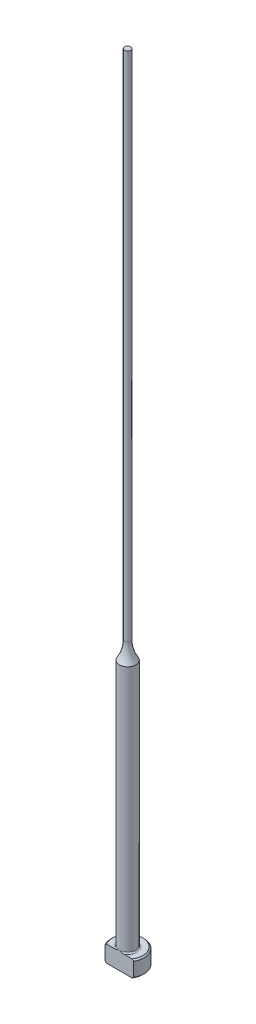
ISO-10303-21;
HEADER;
FILE_DESCRIPTION(('STEP AP214'),'2;1');
FILE_NAME('part.step','',(''),(''),'','','');
FILE_SCHEMA(('AUTOMOTIVE_DESIGN { 1 0 10303 214 1 1 1 1 }'));
ENDSEC;
DATA;
#1=APPLICATION_CONTEXT('core data for automotive mechanical design processes');
#2=APPLICATION_PROTOCOL_DEFINITION('international standard','automotive_design',2000,#1);
#3=PRODUCT_CONTEXT('',#1,'mechanical');
#4=PRODUCT('Part','Part','',(#3));
#5=PRODUCT_RELATED_PRODUCT_CATEGORY('part','',(#4));
#6=PRODUCT_DEFINITION_FORMATION('','',#4);
#7=PRODUCT_DEFINITION_CONTEXT('part definition',#1,'design');
#8=PRODUCT_DEFINITION('design','',#6,#7);
#9=PRODUCT_DEFINITION_SHAPE('','',#8);
#10=(LENGTH_UNIT() NAMED_UNIT(*) SI_UNIT(.MILLI.,.METRE.));
#11=(NAMED_UNIT(*) PLANE_ANGLE_UNIT() SI_UNIT($,.RADIAN.));
#12=(NAMED_UNIT(*) SI_UNIT($,.STERADIAN.) SOLID_ANGLE_UNIT());
#13=UNCERTAINTY_MEASURE_WITH_UNIT(LENGTH_MEASURE(1.E-05),#10,'distance_accuracy_value','');
#14=(GEOMETRIC_REPRESENTATION_CONTEXT(3) GLOBAL_UNCERTAINTY_ASSIGNED_CONTEXT((#13)) GLOBAL_UNIT_ASSIGNED_CONTEXT((#10,
#11,#12)) REPRESENTATION_CONTEXT('',''));
#15=CARTESIAN_POINT('',(0.,0.,0.));
#16=DIRECTION('',(0.,0.,1.));
#17=DIRECTION('',(1.,0.,0.));
#18=AXIS2_PLACEMENT_3D('',#15,#16,#17);
#19=CARTESIAN_POINT('',(-0.594359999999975,152.4,0.));
#20=DIRECTION('',(0.,1.,0.));
#21=DIRECTION('',(0.,0.,1.));
#22=AXIS2_PLACEMENT_3D('',#19,#20,#21);
#23=PLANE('',#22);
#24=CARTESIAN_POINT('',(0.,152.4,0.));
#25=DIRECTION('',(0.,1.,0.));
#26=DIRECTION('',(0.,0.,1.));
#27=AXIS2_PLACEMENT_3D('',#24,#25,#26);
#28=CIRCLE('',#27,0.594359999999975);
#29=CARTESIAN_POINT('',(0.,152.4,0.594359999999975));
#30=VERTEX_POINT('',#29);
#31=EDGE_CURVE('E169',#30,#30,#28,.T.);
#32=ORIENTED_EDGE('',*,*,#31,.T.);
#33=EDGE_LOOP('',(#32));
#34=FACE_BOUND('',#33,.T.);
#35=ADVANCED_FACE('F37',(#34),#23,.T.);
#36=CARTESIAN_POINT('',(0.,259.958771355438,0.));
#37=DIRECTION('',(0.,1.,0.));
#38=DIRECTION('',(0.,0.,1.));
#39=AXIS2_PLACEMENT_3D('',#36,#37,#38);
#40=CYLINDRICAL_SURFACE('',#39,0.594359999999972);
#41=CARTESIAN_POINT('',(0.,54.2097728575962,0.));
#42=DIRECTION('',(0.,1.,0.));
#43=DIRECTION('',(0.,0.,1.));
#44=AXIS2_PLACEMENT_3D('',#41,#42,#43);
#45=CIRCLE('',#44,0.59435999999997);
#46=CARTESIAN_POINT('',(0.,54.2097728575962,0.59435999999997));
#47=VERTEX_POINT('',#46);
#48=EDGE_CURVE('E172',#47,#47,#45,.T.);
#49=ORIENTED_EDGE('',*,*,#48,.T.);
#50=EDGE_LOOP('',(#49));
#51=FACE_BOUND('',#50,.T.);
#52=ORIENTED_EDGE('',*,*,#31,.F.);
#53=EDGE_LOOP('',(#52));
#54=FACE_BOUND('',#53,.T.);
#55=ADVANCED_FACE('F160',(#51,#54),#40,.T.);
#56=CARTESIAN_POINT('',(0.,54.2097728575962,0.));
#57=DIRECTION('',(0.,1.,0.));
#58=DIRECTION('',(0.,0.,1.));
#59=AXIS2_PLACEMENT_3D('',#56,#57,#58);
#60=TOROIDAL_SURFACE('',#59,6.94435999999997,6.35);
#61=CARTESIAN_POINT('',(0.,50.8,0.));
#62=DIRECTION('',(0.,1.,0.));
#63=DIRECTION('',(0.,0.,1.));
#64=AXIS2_PLACEMENT_3D('',#61,#62,#63);
#65=CIRCLE('',#64,1.58749999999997);
#66=CARTESIAN_POINT('',(0.,50.8,1.58749999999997));
#67=VERTEX_POINT('',#66);
#68=EDGE_CURVE('E100',#67,#67,#65,.T.);
#69=ORIENTED_EDGE('',*,*,#68,.T.);
#70=EDGE_LOOP('',(#69));
#71=FACE_BOUND('',#70,.T.);
#72=ORIENTED_EDGE('',*,*,#48,.F.);
#73=EDGE_LOOP('',(#72));
#74=FACE_BOUND('',#73,.T.);
#75=ADVANCED_FACE('F165',(#71,#74),#60,.F.);
#76=CARTESIAN_POINT('',(0.,259.958771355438,0.));
#77=DIRECTION('',(0.,1.,0.));
#78=DIRECTION('',(0.,0.,1.));
#79=AXIS2_PLACEMENT_3D('',#76,#77,#78);
#80=CYLINDRICAL_SURFACE('',#79,1.58749999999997);
#81=CARTESIAN_POINT('',(0.,3.42900000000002,0.));
#82=DIRECTION('',(0.,1.,0.));
#83=DIRECTION('',(0.,0.,1.));
#84=AXIS2_PLACEMENT_3D('',#81,#82,#83);
#85=CIRCLE('',#84,1.58749999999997);
#86=CARTESIAN_POINT('',(0.,3.42900000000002,1.58749999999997));
#87=VERTEX_POINT('',#86);
#88=EDGE_CURVE('E109',#87,#87,#85,.T.);
#89=ORIENTED_EDGE('',*,*,#88,.T.);
#90=EDGE_LOOP('',(#89));
#91=FACE_BOUND('',#90,.T.);
#92=ORIENTED_EDGE('',*,*,#68,.F.);
#93=EDGE_LOOP('',(#92));
#94=FACE_BOUND('',#93,.T.);
#95=ADVANCED_FACE('F192',(#91,#94),#80,.T.);
#96=CARTESIAN_POINT('',(-3.17499999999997,3.175,0.));
#97=DIRECTION('',(0.,1.,0.));
#98=DIRECTION('',(0.,0.,1.));
#99=AXIS2_PLACEMENT_3D('',#96,#97,#98);
#100=PLANE('',#99);
#101=DIRECTION('',(-1.,0.,0.));
#102=VECTOR('',#101,1.);
#103=CARTESIAN_POINT('',(-3.17499999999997,3.175,1.58749999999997));
#104=LINE('',#103,#102);
#105=CARTESIAN_POINT('',(2.45195529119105,3.175,1.58749999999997));
#106=VERTEX_POINT('',#105);
#107=CARTESIAN_POINT('',(0.933255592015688,3.175,1.58749999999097));
#108=VERTEX_POINT('',#107);
#109=EDGE_CURVE('E58',#106,#108,#104,.T.);
#110=ORIENTED_EDGE('',*,*,#109,.F.);
#111=CARTESIAN_POINT('',(0.,3.175,0.));
#112=DIRECTION('',(0.,1.,0.));
#113=DIRECTION('',(0.,0.,1.));
#114=AXIS2_PLACEMENT_3D('',#111,#112,#113);
#115=CIRCLE('',#114,2.92099999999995);
#116=CARTESIAN_POINT('',(-2.45195529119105,3.175,1.58749999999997));
#117=VERTEX_POINT('',#116);
#118=EDGE_CURVE('E171',#106,#117,#115,.T.);
#119=ORIENTED_EDGE('',*,*,#118,.T.);
#120=CARTESIAN_POINT('',(-0.933255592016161,3.17500000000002,1.58749999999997));
#121=VERTEX_POINT('',#120);
#122=EDGE_CURVE('E140',#121,#117,#104,.T.);
#123=ORIENTED_EDGE('',*,*,#122,.F.);
#124=CARTESIAN_POINT('',(0.,3.175,0.));
#125=DIRECTION('',(0.,1.,0.));
#126=DIRECTION('',(0.,0.,1.));
#127=AXIS2_PLACEMENT_3D('',#124,#125,#126);
#128=CIRCLE('',#127,1.84149999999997);
#129=EDGE_CURVE('E113',#121,#108,#128,.F.);
#130=ORIENTED_EDGE('',*,*,#129,.T.);
#131=EDGE_LOOP('',(#110,#119,#123,#130));
#132=FACE_BOUND('',#131,.T.);
#133=ADVANCED_FACE('F189',(#132),#100,.T.);
#134=CARTESIAN_POINT('',(0.,259.958771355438,0.));
#135=DIRECTION('',(0.,1.,0.));
#136=DIRECTION('',(0.,0.,1.));
#137=AXIS2_PLACEMENT_3D('',#134,#135,#136);
#138=CYLINDRICAL_SURFACE('',#137,3.17499999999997);
#139=DIRECTION('',(0.,-1.,0.));
#140=VECTOR('',#139,1.);
#141=CARTESIAN_POINT('',(-2.74963065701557,152.4,1.58749999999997));
#142=LINE('',#141,#140);
#143=CARTESIAN_POINT('',(-2.74963065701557,2.921,1.58749999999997));
#144=VERTEX_POINT('',#143);
#145=CARTESIAN_POINT('',(-2.74963065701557,0.254000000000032,1.58749999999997));
#146=VERTEX_POINT('',#145);
#147=EDGE_CURVE('E95',#144,#146,#142,.T.);
#148=ORIENTED_EDGE('',*,*,#147,.F.);
#149=CARTESIAN_POINT('',(0.,2.92100000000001,0.));
#150=DIRECTION('',(0.,1.,0.));
#151=DIRECTION('',(0.,0.,1.));
#152=AXIS2_PLACEMENT_3D('',#149,#150,#151);
#153=CIRCLE('',#152,3.17499999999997);
#154=CARTESIAN_POINT('',(2.74963065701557,2.921,1.58749999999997));
#155=VERTEX_POINT('',#154);
#156=EDGE_CURVE('E110',#144,#155,#153,.F.);
#157=ORIENTED_EDGE('',*,*,#156,.T.);
#158=DIRECTION('',(0.,-1.,0.));
#159=VECTOR('',#158,1.);
#160=CARTESIAN_POINT('',(2.74963065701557,152.4,1.58749999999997));
#161=LINE('',#160,#159);
#162=CARTESIAN_POINT('',(2.74963065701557,0.254000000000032,1.58749999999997));
#163=VERTEX_POINT('',#162);
#164=EDGE_CURVE('E182',#155,#163,#161,.T.);
#165=ORIENTED_EDGE('',*,*,#164,.T.);
#166=CARTESIAN_POINT('',(0.,0.254000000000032,0.));
#167=DIRECTION('',(0.,-1.,0.));
#168=DIRECTION('',(0.,0.,-1.));
#169=AXIS2_PLACEMENT_3D('',#166,#167,#168);
#170=CIRCLE('',#169,3.17499999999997);
#171=EDGE_CURVE('E116',#163,#146,#170,.F.);
#172=ORIENTED_EDGE('',*,*,#171,.T.);
#173=EDGE_LOOP('',(#148,#157,#165,#172));
#174=FACE_BOUND('',#173,.T.);
#175=ADVANCED_FACE('F180',(#174),#138,.T.);
#176=CARTESIAN_POINT('',(0.,0.,0.));
#177=DIRECTION('',(0.,-1.,0.));
#178=DIRECTION('',(0.,0.,-1.));
#179=AXIS2_PLACEMENT_3D('',#176,#177,#178);
#180=PLANE('',#179);
#181=DIRECTION('',(1.,0.,0.));
#182=VECTOR('',#181,1.);
#183=CARTESIAN_POINT('',(-2.74963065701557,0.,1.58749999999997));
#184=LINE('',#183,#182);
#185=CARTESIAN_POINT('',(-2.45195529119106,0.,1.58749999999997));
#186=VERTEX_POINT('',#185);
#187=CARTESIAN_POINT('',(2.45195529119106,0.,1.58749999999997));
#188=VERTEX_POINT('',#187);
#189=EDGE_CURVE('E92',#186,#188,#184,.T.);
#190=ORIENTED_EDGE('',*,*,#189,.F.);
#191=CARTESIAN_POINT('',(0.,0.,0.));
#192=DIRECTION('',(0.,-1.,0.));
#193=DIRECTION('',(0.,0.,-1.));
#194=AXIS2_PLACEMENT_3D('',#191,#192,#193);
#195=CIRCLE('',#194,2.92099999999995);
#196=EDGE_CURVE('E106',#186,#188,#195,.T.);
#197=ORIENTED_EDGE('',*,*,#196,.T.);
#198=EDGE_LOOP('',(#190,#197));
#199=FACE_BOUND('',#198,.T.);
#200=ADVANCED_FACE('F105',(#199),#180,.T.);
#201=CARTESIAN_POINT('',(0.,3.17499999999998,0.));
#202=DIRECTION('',(0.,-1.,0.));
#203=DIRECTION('',(0.,0.,-1.));
#204=AXIS2_PLACEMENT_3D('',#201,#202,#203);
#205=CONICAL_SURFACE('',#204,2.92099999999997,0.7853981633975);
#206=CARTESIAN_POINT('',(2.75033065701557,2.9203937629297,1.58749999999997));
#207=CARTESIAN_POINT('',(2.66887796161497,2.99091042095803,1.58749999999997));
#208=CARTESIAN_POINT('',(2.58705989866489,3.0610138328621,1.58749999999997));
#209=CARTESIAN_POINT('',(2.42241022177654,3.20009957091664,1.58749999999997));
#210=CARTESIAN_POINT('',(2.33957813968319,3.26908134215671,1.58749999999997));
#211=CARTESIAN_POINT('',(2.17073968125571,3.40716024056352,1.58749999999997));
#212=CARTESIAN_POINT('',(2.08470440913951,3.47622217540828,1.58749999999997));
#213=CARTESIAN_POINT('',(1.91099881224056,3.61222325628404,1.58749999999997));
#214=CARTESIAN_POINT('',(1.82332890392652,3.67916293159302,1.58749999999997));
#215=CARTESIAN_POINT('',(1.64569223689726,3.81020667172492,1.58749999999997));
#216=CARTESIAN_POINT('',(1.55572245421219,3.87430666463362,1.58749999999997));
#217=CARTESIAN_POINT('',(1.37280394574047,3.99833089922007,1.58749999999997));
#218=CARTESIAN_POINT('',(1.27985285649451,4.05825170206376,1.58749999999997));
#219=CARTESIAN_POINT('',(1.09086561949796,4.17130826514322,1.58749999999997));
#220=CARTESIAN_POINT('',(0.99485990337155,4.22449421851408,1.58749999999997));
#221=CARTESIAN_POINT('',(0.798114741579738,4.32122233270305,1.58749999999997));
#222=CARTESIAN_POINT('',(0.697384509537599,4.36478238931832,1.58749999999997));
#223=CARTESIAN_POINT('',(0.541185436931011,4.4195165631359,1.58749999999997));
#224=CARTESIAN_POINT('',(0.487627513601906,4.43611950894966,1.58749999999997));
#225=CARTESIAN_POINT('',(0.379267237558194,4.46466012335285,1.58749999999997));
#226=CARTESIAN_POINT('',(0.324465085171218,4.47659853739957,1.58749999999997));
#227=CARTESIAN_POINT('',(0.214272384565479,4.49501904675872,1.58749999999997));
#228=CARTESIAN_POINT('',(0.158887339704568,4.50153345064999,1.58749999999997));
#229=CARTESIAN_POINT('',(0.0477364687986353,4.50875028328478,1.58749999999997));
#230=CARTESIAN_POINT('',(-0.00802931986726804,4.50945327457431,1.58749999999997));
#231=CARTESIAN_POINT('',(-0.119372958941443,4.50499163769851,1.58749999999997));
#232=CARTESIAN_POINT('',(-0.174950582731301,4.49982147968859,1.58749999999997));
#233=CARTESIAN_POINT('',(-0.285312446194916,4.48399101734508,1.58749999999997));
#234=CARTESIAN_POINT('',(-0.340096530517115,4.47332965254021,1.58749999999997));
#235=CARTESIAN_POINT('',(-0.448865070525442,4.44711334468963,1.58749999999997));
#236=CARTESIAN_POINT('',(-0.50284128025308,4.43152477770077,1.58749999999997));
#237=CARTESIAN_POINT('',(-0.609429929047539,4.39628553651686,1.58749999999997));
#238=CARTESIAN_POINT('',(-0.66204236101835,4.3766348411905,1.58749999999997));
#239=CARTESIAN_POINT('',(-0.778129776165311,4.32902110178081,1.58749999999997));
#240=CARTESIAN_POINT('',(-0.84124591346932,4.30019026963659,1.58749999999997));
#241=CARTESIAN_POINT('',(-0.965594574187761,4.23868811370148,1.58749999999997));
#242=CARTESIAN_POINT('',(-1.02682597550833,4.20601455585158,1.58749999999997));
#243=CARTESIAN_POINT('',(-1.14774341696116,4.13769010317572,1.58749999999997));
#244=CARTESIAN_POINT('',(-1.20742632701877,4.10203371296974,1.58749999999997));
#245=CARTESIAN_POINT('',(-1.32539130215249,4.02846531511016,1.58749999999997));
#246=CARTESIAN_POINT('',(-1.38367308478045,3.9905528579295,1.58749999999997));
#247=CARTESIAN_POINT('',(-1.55734442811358,3.87382704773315,1.58749999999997));
#248=CARTESIAN_POINT('',(-1.67095842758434,3.79237897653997,1.58749999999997));
#249=CARTESIAN_POINT('',(-1.8947523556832,3.6252186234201,1.58749999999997));
#250=CARTESIAN_POINT('',(-2.00493591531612,3.53951111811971,1.58749999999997));
#251=CARTESIAN_POINT('',(-2.22248693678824,3.3655494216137,1.58749999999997));
#252=CARTESIAN_POINT('',(-2.32986450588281,3.27730782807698,1.58749999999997));
#253=CARTESIAN_POINT('',(-2.48909538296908,3.14389342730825,1.58749999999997));
#254=CARTESIAN_POINT('',(-2.54159338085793,3.09948435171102,1.58749999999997));
#255=CARTESIAN_POINT('',(-2.64622282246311,3.01024124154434,1.58749999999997));
#256=CARTESIAN_POINT('',(-2.69835428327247,2.96540722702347,1.58749999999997));
#257=CARTESIAN_POINT('',(-2.75033065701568,2.92039376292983,1.58749999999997));
#258=B_SPLINE_CURVE_WITH_KNOTS('',3,(#206,#207,#208,#209,#210,#211,#212,#213,#214,#215,#216,
#217,#218,#219,#220,#221,#222,#223,#224,#225,#226,#227,#228,#229,#230,#231,#232,#233,#234,#235,
#236,#237,#238,#239,#240,#241,#242,#243,#244,#245,#246,#247,#248,#249,#250,#251,#252,#253,#254,
#255,#256,#257),.UNSPECIFIED.,.F.,.F.,(4,2,2,2,2,2,2,2,2,2,2,2,2,2,2,2,2,2,2,2,2,2,2,2,2,4),(0.,
0.323216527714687,0.64658837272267,0.977539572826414,1.30840757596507,1.63973560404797,
1.97133312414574,2.30029221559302,2.62863448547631,2.79668277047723,2.9647041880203,
3.13171746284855,3.29871457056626,3.46586904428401,3.63305581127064,3.80140905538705,
3.96976317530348,4.17775353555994,4.38586541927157,4.59436953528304,4.80291533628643,
5.22209642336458,5.64081759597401,6.0577303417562,6.26401477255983,6.47028951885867),.UNSPECIFIED.);
#259=EDGE_CURVE('E63',#155,#106,#258,.T.);
#260=ORIENTED_EDGE('',*,*,#259,.F.);
#261=ORIENTED_EDGE('',*,*,#156,.F.);
#262=EDGE_CURVE('E133',#117,#144,#258,.T.);
#263=ORIENTED_EDGE('',*,*,#262,.F.);
#264=ORIENTED_EDGE('',*,*,#118,.F.);
#265=EDGE_LOOP('',(#260,#261,#263,#264));
#266=FACE_BOUND('',#265,.T.);
#267=ADVANCED_FACE('F147',(#266),#205,.T.);
#268=CARTESIAN_POINT('',(0.,0.254000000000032,0.));
#269=DIRECTION('',(0.,1.,0.));
#270=DIRECTION('',(0.,0.,1.));
#271=AXIS2_PLACEMENT_3D('',#268,#269,#270);
#272=CONICAL_SURFACE('',#271,3.17499999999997,0.785398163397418);
#273=CARTESIAN_POINT('',(-2.75033065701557,0.254606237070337,1.58749999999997));
#274=CARTESIAN_POINT('',(-2.66887796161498,0.184089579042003,1.58749999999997));
#275=CARTESIAN_POINT('',(-2.58705989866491,0.113986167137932,1.58749999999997));
#276=CARTESIAN_POINT('',(-2.42241022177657,-0.0250995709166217,1.58749999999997));
#277=CARTESIAN_POINT('',(-2.33957813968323,-0.0940813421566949,1.58749999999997));
#278=CARTESIAN_POINT('',(-2.17073968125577,-0.232160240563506,1.58749999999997));
#279=CARTESIAN_POINT('',(-2.08470440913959,-0.301222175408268,1.58749999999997));
#280=CARTESIAN_POINT('',(-1.91099881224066,-0.437223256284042,1.58749999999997));
#281=CARTESIAN_POINT('',(-1.82332890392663,-0.504162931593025,1.58749999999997));
#282=CARTESIAN_POINT('',(-1.64569223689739,-0.635206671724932,1.58749999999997));
#283=CARTESIAN_POINT('',(-1.55572245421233,-0.699306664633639,1.58749999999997));
#284=CARTESIAN_POINT('',(-1.37280394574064,-0.8233308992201,1.58749999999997));
#285=CARTESIAN_POINT('',(-1.27985285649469,-0.883251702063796,1.58749999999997));
#286=CARTESIAN_POINT('',(-1.09086561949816,-0.996308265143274,1.58749999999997));
#287=CARTESIAN_POINT('',(-0.994859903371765,-1.04949421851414,1.58749999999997));
#288=CARTESIAN_POINT('',(-0.798114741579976,-1.14622233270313,1.58749999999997));
#289=CARTESIAN_POINT('',(-0.697384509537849,-1.18978238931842,1.58749999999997));
#290=CARTESIAN_POINT('',(-0.54118543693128,-1.24451656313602,1.58749999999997));
#291=CARTESIAN_POINT('',(-0.487627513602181,-1.26111950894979,1.58749999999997));
#292=CARTESIAN_POINT('',(-0.379267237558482,-1.28966012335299,1.58749999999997));
#293=CARTESIAN_POINT('',(-0.324465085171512,-1.30159853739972,1.58749999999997));
#294=CARTESIAN_POINT('',(-0.214272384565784,-1.3200190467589,1.58749999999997));
#295=CARTESIAN_POINT('',(-0.158887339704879,-1.32653345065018,1.58749999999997));
#296=CARTESIAN_POINT('',(-0.0477364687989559,-1.33375028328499,1.58749999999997));
#297=CARTESIAN_POINT('',(0.00802931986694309,-1.33445327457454,1.58749999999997));
#298=CARTESIAN_POINT('',(0.119372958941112,-1.32999163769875,1.58749999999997));
#299=CARTESIAN_POINT('',(0.174950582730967,-1.32482147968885,1.58749999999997));
#300=CARTESIAN_POINT('',(0.28531244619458,-1.30899101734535,1.58749999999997));
#301=CARTESIAN_POINT('',(0.340096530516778,-1.2983296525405,1.58749999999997));
#302=CARTESIAN_POINT('',(0.448865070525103,-1.27211334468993,1.58749999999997));
#303=CARTESIAN_POINT('',(0.50284128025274,-1.25652477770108,1.58749999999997));
#304=CARTESIAN_POINT('',(0.609429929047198,-1.22128553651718,1.58749999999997));
#305=CARTESIAN_POINT('',(0.662042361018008,-1.20163484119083,1.58749999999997));
#306=CARTESIAN_POINT('',(0.778129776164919,-1.15402110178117,1.58749999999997));
#307=CARTESIAN_POINT('',(0.84124591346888,-1.12519026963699,1.58749999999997));
#308=CARTESIAN_POINT('',(0.965594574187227,-1.06368811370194,1.58749999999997));
#309=CARTESIAN_POINT('',(1.02682597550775,-1.03101455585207,1.58749999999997));
#310=CARTESIAN_POINT('',(1.14774341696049,-0.962690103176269,1.58749999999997));
#311=CARTESIAN_POINT('',(1.20742632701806,-0.927033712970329,1.58749999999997));
#312=CARTESIAN_POINT('',(1.32539130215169,-0.853465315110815,1.58749999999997));
#313=CARTESIAN_POINT('',(1.38367308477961,-0.815552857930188,1.58749999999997));
#314=CARTESIAN_POINT('',(1.5573444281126,-0.698827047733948,1.58749999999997));
#315=CARTESIAN_POINT('',(1.67095842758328,-0.617378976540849,1.58749999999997));
#316=CARTESIAN_POINT('',(1.89475235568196,-0.450218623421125,1.58749999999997));
#317=CARTESIAN_POINT('',(2.0049359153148,-0.364511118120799,1.58749999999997));
#318=CARTESIAN_POINT('',(2.22248693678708,-0.190549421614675,1.58749999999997));
#319=CARTESIAN_POINT('',(2.32986450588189,-0.102307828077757,1.58749999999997));
#320=CARTESIAN_POINT('',(2.48909538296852,0.0311065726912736,1.58749999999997));
#321=CARTESIAN_POINT('',(2.54159338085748,0.0755156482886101,1.58749999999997));
#322=CARTESIAN_POINT('',(2.64622282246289,0.164758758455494,1.58749999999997));
#323=CARTESIAN_POINT('',(2.69835428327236,0.20959277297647,1.58749999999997));
#324=CARTESIAN_POINT('',(2.75033065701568,0.25460623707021,1.58749999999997));
#325=B_SPLINE_CURVE_WITH_KNOTS('',3,(#273,#274,#275,#276,#277,#278,#279,#280,#281,#282,#283,
#284,#285,#286,#287,#288,#289,#290,#291,#292,#293,#294,#295,#296,#297,#298,#299,#300,#301,#302,
#303,#304,#305,#306,#307,#308,#309,#310,#311,#312,#313,#314,#315,#316,#317,#318,#319,#320,#321,
#322,#323,#324),.UNSPECIFIED.,.F.,.F.,(4,2,2,2,2,2,2,2,2,2,2,2,2,2,2,2,2,2,2,2,2,2,2,2,2,4),(0.,
0.323216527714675,0.646588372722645,0.977539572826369,1.308407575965,1.63973560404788,
1.97133312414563,2.3002922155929,2.62863448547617,2.79668277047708,2.96470418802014,
3.13171746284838,3.29871457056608,3.46586904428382,3.63305581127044,3.80140905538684,
3.96976317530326,4.17775353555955,4.38586541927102,4.59436953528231,4.80291533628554,
5.22209642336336,5.64081759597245,6.05773034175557,6.26401477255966,6.47028951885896),.UNSPECIFIED.);
#326=EDGE_CURVE('E89',#146,#186,#325,.T.);
#327=ORIENTED_EDGE('',*,*,#326,.F.);
#328=ORIENTED_EDGE('',*,*,#171,.F.);
#329=EDGE_CURVE('E101',#188,#163,#325,.T.);
#330=ORIENTED_EDGE('',*,*,#329,.F.);
#331=ORIENTED_EDGE('',*,*,#196,.F.);
#332=EDGE_LOOP('',(#327,#328,#330,#331));
#333=FACE_BOUND('',#332,.T.);
#334=ADVANCED_FACE('F108',(#333),#272,.T.);
#335=CARTESIAN_POINT('',(0.,3.42900000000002,0.));
#336=DIRECTION('',(0.,1.,0.));
#337=DIRECTION('',(0.,0.,1.));
#338=AXIS2_PLACEMENT_3D('',#335,#336,#337);
#339=TOROIDAL_SURFACE('',#338,1.84149999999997,0.254);
#340=ORIENTED_EDGE('',*,*,#129,.F.);
#341=CARTESIAN_POINT('',(0.,3.42900000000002,1.58749999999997));
#342=CARTESIAN_POINT('',(-1.9220500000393E-10,3.42900057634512,1.58749999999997));
#343=CARTESIAN_POINT('',(-1.22611614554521E-07,3.42900115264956,1.58749999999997));
#344=CARTESIAN_POINT('',(-5.09676364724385E-07,3.42900226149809,1.58749999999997));
#345=CARTESIAN_POINT('',(-7.78176327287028E-07,3.42900279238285,1.58749999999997));
#346=CARTESIAN_POINT('',(-1.42307272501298E-06,3.42900385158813,1.58749999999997));
#347=CARTESIAN_POINT('',(-1.80713867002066E-06,3.42900437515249,1.58749999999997));
#348=CARTESIAN_POINT('',(-2.63494846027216E-06,3.42900536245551,1.58749999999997));
#349=CARTESIAN_POINT('',(-3.07814756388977E-06,3.42900582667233,1.58749999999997));
#350=CARTESIAN_POINT('',(-4.66897357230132E-06,3.42900738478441,1.58749999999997));
#351=CARTESIAN_POINT('',(-5.89404907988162E-06,3.42900840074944,1.58749999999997));
#352=CARTESIAN_POINT('',(-8.42427510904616E-06,3.42901020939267,1.58749999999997));
#353=CARTESIAN_POINT('',(-9.72480574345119E-06,3.42901100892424,1.58749999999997));
#354=CARTESIAN_POINT('',(-1.48060601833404E-05,3.42901401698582,1.58749999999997));
#355=CARTESIAN_POINT('',(-1.86838281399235E-05,3.42901606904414,1.58749999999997));
#356=CARTESIAN_POINT('',(-2.63261117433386E-05,3.42901942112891,1.58749999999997));
#357=CARTESIAN_POINT('',(-3.0068741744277E-05,3.42902077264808,1.58749999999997));
#358=CARTESIAN_POINT('',(-4.60276298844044E-05,3.42902652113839,1.58749999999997));
#359=CARTESIAN_POINT('',(-5.82470198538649E-05,3.42903088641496,1.58749999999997));
#360=CARTESIAN_POINT('',(-8.11070097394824E-05,3.42903788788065,1.58749999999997));
#361=CARTESIAN_POINT('',(-9.16953114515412E-05,3.42904068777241,1.58749999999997));
#362=CARTESIAN_POINT('',(-0.000168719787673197,3.42906287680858,1.58749999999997));
#363=CARTESIAN_POINT('',(-0.000232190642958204,3.4290911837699,1.58749999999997));
#364=CARTESIAN_POINT('',(-0.000479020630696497,3.42919723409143,1.58749999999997));
#365=CARTESIAN_POINT('',(-0.000664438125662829,3.42926834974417,1.58749999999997));
#366=CARTESIAN_POINT('',(-0.0013844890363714,3.42954862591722,1.58749999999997));
#367=CARTESIAN_POINT('',(-0.00191701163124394,3.42976473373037,1.58749999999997));
#368=CARTESIAN_POINT('',(-0.00409774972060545,3.4306455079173,1.58749999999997));
#369=CARTESIAN_POINT('',(-0.00574830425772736,3.43130231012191,1.58749999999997));
#370=CARTESIAN_POINT('',(-0.0289985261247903,3.4405594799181,1.58749999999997));
#371=CARTESIAN_POINT('',(-0.0505816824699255,3.4492167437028,1.58749999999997));
#372=CARTESIAN_POINT('',(-0.0929947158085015,3.46610702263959,1.58749999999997));
#373=CARTESIAN_POINT('',(-0.113823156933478,3.47434394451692,1.58749999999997));
#374=CARTESIAN_POINT('',(-0.157956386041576,3.49164606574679,1.58749999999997));
#375=CARTESIAN_POINT('',(-0.181267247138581,3.50069608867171,1.58749999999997));
#376=CARTESIAN_POINT('',(-0.228222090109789,3.51863224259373,1.58749999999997));
#377=CARTESIAN_POINT('',(-0.25186705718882,3.52751579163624,1.58749999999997));
#378=CARTESIAN_POINT('',(-0.310512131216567,3.54905503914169,1.58749999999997));
#379=CARTESIAN_POINT('',(-0.345588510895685,3.56150550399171,1.58749999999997));
#380=CARTESIAN_POINT('',(-0.415278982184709,3.5850302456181,1.58749999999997));
#381=CARTESIAN_POINT('',(-0.449884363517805,3.59613012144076,1.58749999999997));
#382=CARTESIAN_POINT('',(-0.524471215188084,3.61841679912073,1.58749999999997));
#383=CARTESIAN_POINT('',(-0.564517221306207,3.62939137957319,1.58749999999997));
#384=CARTESIAN_POINT('',(-0.645529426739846,3.6489746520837,1.58749999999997));
#385=CARTESIAN_POINT('',(-0.686500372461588,3.65756417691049,1.58749999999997));
#386=CARTESIAN_POINT('',(-0.771546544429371,3.67188287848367,1.58749999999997));
#387=CARTESIAN_POINT('',(-0.815658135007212,3.67740449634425,1.58749999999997));
#388=CARTESIAN_POINT('',(-0.904117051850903,3.68344603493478,1.58749999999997));
#389=CARTESIAN_POINT('',(-0.948462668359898,3.68398638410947,1.58749999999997));
#390=CARTESIAN_POINT('',(-1.02531896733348,3.67901051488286,1.58749999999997));
#391=CARTESIAN_POINT('',(-1.05792141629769,3.67502604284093,1.58749999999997));
#392=CARTESIAN_POINT('',(-1.12184393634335,3.66230832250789,1.58749999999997));
#393=CARTESIAN_POINT('',(-1.1531753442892,3.65363950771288,1.58749999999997));
#394=CARTESIAN_POINT('',(-1.19946468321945,3.6356384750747,1.58749999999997));
#395=CARTESIAN_POINT('',(-1.21526783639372,3.62848492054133,1.58749999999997));
#396=CARTESIAN_POINT('',(-1.24583726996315,3.61212937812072,1.58749999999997));
#397=CARTESIAN_POINT('',(-1.26060215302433,3.60292469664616,1.58749999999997));
#398=CARTESIAN_POINT('',(-1.28575815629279,3.58421518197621,1.58749999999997));
#399=CARTESIAN_POINT('',(-1.29644383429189,3.57510998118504,1.58749999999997));
#400=CARTESIAN_POINT('',(-1.31623154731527,3.55531539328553,1.58749999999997));
#401=CARTESIAN_POINT('',(-1.32533681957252,3.54462932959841,1.58749999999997));
#402=CARTESIAN_POINT('',(-1.33941140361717,3.52450022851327,1.58749999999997));
#403=CARTESIAN_POINT('',(-1.34484814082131,3.51538553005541,1.58749999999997));
#404=CARTESIAN_POINT('',(-1.35416329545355,3.49638544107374,1.58749999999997));
#405=CARTESIAN_POINT('',(-1.35804267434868,3.48650053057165,1.58749999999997));
#406=CARTESIAN_POINT('',(-1.36398436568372,3.46611321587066,1.58749999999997));
#407=CARTESIAN_POINT('',(-1.36603350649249,3.45560690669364,1.58749999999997));
#408=CARTESIAN_POINT('',(-1.3680840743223,3.43439627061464,1.58749999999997));
#409=CARTESIAN_POINT('',(-1.36808648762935,3.42369204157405,1.58749999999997));
#410=CARTESIAN_POINT('',(-1.36616208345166,3.40366716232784,1.58749999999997));
#411=CARTESIAN_POINT('',(-1.36444960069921,3.39432493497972,1.58749999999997));
#412=CARTESIAN_POINT('',(-1.35953338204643,3.37604480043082,1.58749999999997));
#413=CARTESIAN_POINT('',(-1.3563294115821,3.36710695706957,1.58749999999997));
#414=CARTESIAN_POINT('',(-1.34848006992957,3.34949697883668,1.58749999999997));
#415=CARTESIAN_POINT('',(-1.34378578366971,3.34084688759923,1.58749999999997));
#416=CARTESIAN_POINT('',(-1.33324445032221,3.32428742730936,1.58749999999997));
#417=CARTESIAN_POINT('',(-1.32739692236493,3.31637836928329,1.58749999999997));
#418=CARTESIAN_POINT('',(-1.31107304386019,3.29692878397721,1.58749999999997));
#419=CARTESIAN_POINT('',(-1.29989286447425,3.28597778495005,1.58749999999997));
#420=CARTESIAN_POINT('',(-1.27593566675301,3.26597490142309,1.58749999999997));
#421=CARTESIAN_POINT('',(-1.2631537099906,3.25692913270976,1.58749999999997));
#422=CARTESIAN_POINT('',(-1.22930733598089,3.23613976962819,1.58749999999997));
#423=CARTESIAN_POINT('',(-1.20751096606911,3.22559415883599,1.58749999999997));
#424=CARTESIAN_POINT('',(-1.16266144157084,3.20795356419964,1.58749999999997));
#425=CARTESIAN_POINT('',(-1.13960937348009,3.20085564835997,1.58749999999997));
#426=CARTESIAN_POINT('',(-1.07603916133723,3.18534571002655,1.58749999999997));
#427=CARTESIAN_POINT('',(-1.03486686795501,3.17965078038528,1.58749999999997));
#428=CARTESIAN_POINT('',(-0.951558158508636,3.1741711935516,1.58749999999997));
#429=CARTESIAN_POINT('',(-0.909417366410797,3.17449023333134,1.58749999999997));
#430=CARTESIAN_POINT('',(-0.811383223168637,3.18054602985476,1.58749999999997));
#431=CARTESIAN_POINT('',(-0.755610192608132,3.18806126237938,1.58749999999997));
#432=CARTESIAN_POINT('',(-0.644937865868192,3.20866626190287,1.58749999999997));
#433=CARTESIAN_POINT('',(-0.590043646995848,3.2217810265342,1.58749999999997));
#434=CARTESIAN_POINT('',(-0.485757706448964,3.25059077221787,1.58749999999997));
#435=CARTESIAN_POINT('',(-0.436281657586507,3.2659890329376,1.58749999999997));
#436=CARTESIAN_POINT('',(-0.338551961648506,3.29877502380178,1.58749999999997));
#437=CARTESIAN_POINT('',(-0.290291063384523,3.31614156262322,1.58749999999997));
#438=CARTESIAN_POINT('',(-0.225557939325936,3.34039762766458,1.58749999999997));
#439=CARTESIAN_POINT('',(-0.208874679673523,3.34673586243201,1.58749999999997));
#440=CARTESIAN_POINT('',(-0.175123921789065,3.35969957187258,1.58749999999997));
#441=CARTESIAN_POINT('',(-0.158057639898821,3.36632823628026,1.58749999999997));
#442=CARTESIAN_POINT('',(-0.117638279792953,3.38214476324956,1.58749999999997));
#443=CARTESIAN_POINT('',(-0.0943002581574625,3.39137029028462,1.58749999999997));
#444=CARTESIAN_POINT('',(-0.049782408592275,3.40910304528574,1.58749999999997));
#445=CARTESIAN_POINT('',(-0.028598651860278,3.41759960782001,1.58749999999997));
#446=CARTESIAN_POINT('',(-0.00575168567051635,3.42669635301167,1.58749999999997));
#447=CARTESIAN_POINT('',(-0.00410451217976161,3.42735181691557,1.58749999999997));
#448=CARTESIAN_POINT('',(-0.00192459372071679,3.42823223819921,1.58749999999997));
#449=CARTESIAN_POINT('',(-0.00138952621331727,3.42844937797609,1.58749999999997));
#450=CARTESIAN_POINT('',(-0.000666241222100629,3.42873091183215,1.58749999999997));
#451=CARTESIAN_POINT('',(-0.000480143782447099,3.42880228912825,1.58749999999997));
#452=CARTESIAN_POINT('',(-0.000232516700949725,3.4289086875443,1.58749999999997));
#453=CARTESIAN_POINT('',(-0.00016892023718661,3.42893705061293,1.58749999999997));
#454=CARTESIAN_POINT('',(-9.17527161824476E-05,3.42895927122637,1.58749999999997));
#455=CARTESIAN_POINT('',(-8.11550293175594E-05,3.42896207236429,1.58749999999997));
#456=CARTESIAN_POINT('',(-5.82743948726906E-05,3.4289690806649,1.58749999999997));
#457=CARTESIAN_POINT('',(-4.60440001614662E-05,3.4289734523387,1.58749999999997));
#458=CARTESIAN_POINT('',(-3.00727682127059E-05,3.42897920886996,1.58749999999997));
#459=CARTESIAN_POINT('',(-2.63286807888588E-05,3.42898056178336,1.58749999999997));
#460=CARTESIAN_POINT('',(-1.86836529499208E-05,3.42898391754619,1.58749999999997));
#461=CARTESIAN_POINT('',(-1.48046517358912E-05,3.42898597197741,1.58749999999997));
#462=CARTESIAN_POINT('',(-9.72223943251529E-06,3.42898898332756,1.58749999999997));
#463=CARTESIAN_POINT('',(-8.4215964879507E-06,3.4289897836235,1.58749999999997));
#464=CARTESIAN_POINT('',(-5.89129728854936E-06,3.428991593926,1.58749999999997));
#465=CARTESIAN_POINT('',(-4.66626866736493E-06,3.42899261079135,1.58749999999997));
#466=CARTESIAN_POINT('',(-3.07568803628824E-06,3.42899417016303,1.58749999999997));
#467=CARTESIAN_POINT('',(-2.63259565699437E-06,3.42899463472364,1.58749999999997));
#468=CARTESIAN_POINT('',(-1.80506085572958E-06,3.42899562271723,1.58749999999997));
#469=CARTESIAN_POINT('',(-1.42116387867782E-06,3.4289961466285,1.58749999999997));
#470=CARTESIAN_POINT('',(-7.76675642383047E-07,3.42899720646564,1.58749999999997));
#471=CARTESIAN_POINT('',(-5.08406487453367E-07,3.42899773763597,1.58749999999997));
#472=CARTESIAN_POINT('',(-1.21901887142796E-07,3.42899884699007,1.58749999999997));
#473=CARTESIAN_POINT('',(1.92251529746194E-10,3.42899942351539,1.58749999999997));
#474=CARTESIAN_POINT('',(0.,3.42900000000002,1.58749999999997));
#475=B_SPLINE_CURVE_WITH_KNOTS('',3,(#341,#342,#343,#344,#345,#346,#347,#348,#349,#350,#351,
#352,#353,#354,#355,#356,#357,#358,#359,#360,#361,#362,#363,#364,#365,#366,#367,#368,#369,#370,
#371,#372,#373,#374,#375,#376,#377,#378,#379,#380,#381,#382,#383,#384,#385,#386,#387,#388,#389,
#390,#391,#392,#393,#394,#395,#396,#397,#398,#399,#400,#401,#402,#403,#404,#405,#406,#407,#408,
#409,#410,#411,#412,#413,#414,#415,#416,#417,#418,#419,#420,#421,#422,#423,#424,#425,#426,#427,
#428,#429,#430,#431,#432,#433,#434,#435,#436,#437,#438,#439,#440,#441,#442,#443,#444,#445,#446,
#447,#448,#449,#450,#451,#452,#453,#454,#455,#456,#457,#458,#459,#460,#461,#462,#463,#464,#465,
#466,#467,#468,#469,#470,#471,#472,#473,#474),.UNSPECIFIED.,.T.,.F.,(4,2,2,2,2,2,2,2,2,2,2,2,2,
2,2,2,2,2,2,2,2,2,2,2,2,2,2,2,2,2,2,2,2,2,2,2,2,2,2,2,2,2,2,2,2,2,2,2,2,2,2,2,2,2,2,2,2,2,2,2,2,
2,2,2,2,2,4),(0.,1.72815459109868E-06,3.50429256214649E-06,5.44431005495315E-06,
7.36755250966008E-06,1.21190896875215E-05,1.66953775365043E-05,2.98160400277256E-05,
4.17409564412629E-05,8.06604753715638E-05,0.000113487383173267,0.000321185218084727,
0.000917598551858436,0.00264089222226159,0.00797105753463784,0.0777276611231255,
0.144923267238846,0.219939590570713,0.295714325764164,0.407362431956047,0.516367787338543,
0.640878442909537,0.766362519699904,0.899536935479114,1.03216495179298,1.130457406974,
1.22743103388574,1.27935899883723,1.33135556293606,1.3733324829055,1.41522237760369,
1.44693946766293,1.47863694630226,1.51056074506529,1.54246916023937,1.57083210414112,
1.59919951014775,1.62861579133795,1.65804436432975,1.70472658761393,1.75155645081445,
1.82378709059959,1.89595619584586,2.01995471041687,2.14609321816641,2.31447224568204,
2.4836109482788,2.63898919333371,2.79283011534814,2.8463703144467,2.90129461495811,
2.9765823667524,3.04504771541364,3.05036697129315,3.0520984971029,3.0526970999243,
3.05290520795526,3.05293806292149,3.05297701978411,3.05298895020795,3.05300207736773,
3.05300665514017,3.05301140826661,3.0530133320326,3.05301527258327,3.05301704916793,
3.05301877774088),.UNSPECIFIED.);
#476=EDGE_CURVE('E11',#121,#87,#475,.T.);
#477=ORIENTED_EDGE('',*,*,#476,.T.);
#478=ORIENTED_EDGE('',*,*,#88,.F.);
#479=CARTESIAN_POINT('',(0.,3.42900000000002,1.58749999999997));
#480=CARTESIAN_POINT('',(1.92205030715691E-10,3.42899942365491,1.58749999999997));
#481=CARTESIAN_POINT('',(1.22611614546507E-07,3.42899884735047,1.58749999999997));
#482=CARTESIAN_POINT('',(5.09676364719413E-07,3.42899773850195,1.58749999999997));
#483=CARTESIAN_POINT('',(7.78176327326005E-07,3.42899720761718,1.58749999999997));
#484=CARTESIAN_POINT('',(1.42307272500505E-06,3.4289961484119,1.58749999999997));
#485=CARTESIAN_POINT('',(1.80713866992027E-06,3.42899562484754,1.58749999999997));
#486=CARTESIAN_POINT('',(2.63494846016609E-06,3.42899463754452,1.58749999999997));
#487=CARTESIAN_POINT('',(3.07814756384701E-06,3.4289941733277,1.58749999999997));
#488=CARTESIAN_POINT('',(4.66897357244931E-06,3.42899261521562,1.58749999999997));
#489=CARTESIAN_POINT('',(5.89404907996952E-06,3.42899159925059,1.58749999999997));
#490=CARTESIAN_POINT('',(8.42427510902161E-06,3.42898979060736,1.58749999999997));
#491=CARTESIAN_POINT('',(9.72480574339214E-06,3.42898899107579,1.58749999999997));
#492=CARTESIAN_POINT('',(1.48060601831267E-05,3.42898598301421,1.58749999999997));
#493=CARTESIAN_POINT('',(1.86838281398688E-05,3.42898393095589,1.58749999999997));
#494=CARTESIAN_POINT('',(2.63261117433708E-05,3.42898057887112,1.58749999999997));
#495=CARTESIAN_POINT('',(3.00687417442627E-05,3.42897922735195,1.58749999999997));
#496=CARTESIAN_POINT('',(4.6027629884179E-05,3.42897347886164,1.58749999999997));
#497=CARTESIAN_POINT('',(5.82470198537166E-05,3.42896911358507,1.58749999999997));
#498=CARTESIAN_POINT('',(8.1107009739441E-05,3.42896211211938,1.58749999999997));
#499=CARTESIAN_POINT('',(9.16953114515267E-05,3.42895931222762,1.58749999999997));
#500=CARTESIAN_POINT('',(0.00016871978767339,3.42893712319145,1.58749999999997));
#501=CARTESIAN_POINT('',(0.000232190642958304,3.42890881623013,1.58749999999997));
#502=CARTESIAN_POINT('',(0.000479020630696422,3.4288027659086,1.58749999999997));
#503=CARTESIAN_POINT('',(0.000664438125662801,3.42873165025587,1.58749999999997));
#504=CARTESIAN_POINT('',(0.0013844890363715,3.42845137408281,1.58749999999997));
#505=CARTESIAN_POINT('',(0.00191701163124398,3.42823526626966,1.58749999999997));
#506=CARTESIAN_POINT('',(0.00409774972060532,3.42735449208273,1.58749999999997));
#507=CARTESIAN_POINT('',(0.0057483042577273,3.42669768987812,1.58749999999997));
#508=CARTESIAN_POINT('',(0.028998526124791,3.41744052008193,1.58749999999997));
#509=CARTESIAN_POINT('',(0.0505816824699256,3.40878325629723,1.58749999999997));
#510=CARTESIAN_POINT('',(0.0929947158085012,3.39189297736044,1.58749999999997));
#511=CARTESIAN_POINT('',(0.113823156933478,3.38365605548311,1.58749999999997));
#512=CARTESIAN_POINT('',(0.157956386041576,3.36635393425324,1.58749999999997));
#513=CARTESIAN_POINT('',(0.181267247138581,3.35730391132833,1.58749999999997));
#514=CARTESIAN_POINT('',(0.228222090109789,3.3393677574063,1.58749999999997));
#515=CARTESIAN_POINT('',(0.25186705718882,3.33048420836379,1.58749999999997));
#516=CARTESIAN_POINT('',(0.310512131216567,3.30894496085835,1.58749999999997));
#517=CARTESIAN_POINT('',(0.345588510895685,3.29649449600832,1.58749999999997));
#518=CARTESIAN_POINT('',(0.415278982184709,3.27296975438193,1.58749999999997));
#519=CARTESIAN_POINT('',(0.449884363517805,3.26186987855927,1.58749999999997));
#520=CARTESIAN_POINT('',(0.524471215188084,3.2395832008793,1.58749999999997));
#521=CARTESIAN_POINT('',(0.564517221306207,3.22860862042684,1.58749999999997));
#522=CARTESIAN_POINT('',(0.645529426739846,3.20902534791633,1.58749999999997));
#523=CARTESIAN_POINT('',(0.686500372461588,3.20043582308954,1.58749999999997));
#524=CARTESIAN_POINT('',(0.771546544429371,3.18611712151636,1.58749999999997));
#525=CARTESIAN_POINT('',(0.815658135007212,3.18059550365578,1.58749999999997));
#526=CARTESIAN_POINT('',(0.904117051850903,3.17455396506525,1.58749999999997));
#527=CARTESIAN_POINT('',(0.948462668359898,3.17401361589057,1.58749999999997));
#528=CARTESIAN_POINT('',(1.02531896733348,3.17898948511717,1.58749999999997));
#529=CARTESIAN_POINT('',(1.05792141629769,3.1829739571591,1.58749999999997));
#530=CARTESIAN_POINT('',(1.12184393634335,3.19569167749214,1.58749999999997));
#531=CARTESIAN_POINT('',(1.1531753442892,3.20436049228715,1.58749999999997));
#532=CARTESIAN_POINT('',(1.19946468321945,3.22236152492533,1.58749999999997));
#533=CARTESIAN_POINT('',(1.21526783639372,3.2295150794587,1.58749999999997));
#534=CARTESIAN_POINT('',(1.24583726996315,3.24587062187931,1.58749999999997));
#535=CARTESIAN_POINT('',(1.26060215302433,3.25507530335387,1.58749999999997));
#536=CARTESIAN_POINT('',(1.28575815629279,3.27378481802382,1.58749999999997));
#537=CARTESIAN_POINT('',(1.29644383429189,3.28289001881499,1.58749999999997));
#538=CARTESIAN_POINT('',(1.31623154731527,3.30268460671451,1.58749999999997));
#539=CARTESIAN_POINT('',(1.32533681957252,3.31337067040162,1.58749999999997));
#540=CARTESIAN_POINT('',(1.33941140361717,3.33349977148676,1.58749999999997));
#541=CARTESIAN_POINT('',(1.34484814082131,3.34261446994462,1.58749999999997));
#542=CARTESIAN_POINT('',(1.35416329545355,3.36161455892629,1.58749999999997));
#543=CARTESIAN_POINT('',(1.35804267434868,3.37149946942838,1.58749999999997));
#544=CARTESIAN_POINT('',(1.36398436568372,3.39188678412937,1.58749999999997));
#545=CARTESIAN_POINT('',(1.36603350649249,3.40239309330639,1.58749999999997));
#546=CARTESIAN_POINT('',(1.3680840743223,3.42360372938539,1.58749999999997));
#547=CARTESIAN_POINT('',(1.36808648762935,3.43430795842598,1.58749999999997));
#548=CARTESIAN_POINT('',(1.36616208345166,3.45433283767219,1.58749999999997));
#549=CARTESIAN_POINT('',(1.36444960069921,3.46367506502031,1.58749999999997));
#550=CARTESIAN_POINT('',(1.35953338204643,3.48195519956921,1.58749999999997));
#551=CARTESIAN_POINT('',(1.3563294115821,3.49089304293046,1.58749999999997));
#552=CARTESIAN_POINT('',(1.34848006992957,3.50850302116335,1.58749999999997));
#553=CARTESIAN_POINT('',(1.34378578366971,3.5171531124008,1.58749999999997));
#554=CARTESIAN_POINT('',(1.33324445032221,3.53371257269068,1.58749999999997));
#555=CARTESIAN_POINT('',(1.32739692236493,3.54162163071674,1.58749999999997));
#556=CARTESIAN_POINT('',(1.31107304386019,3.56107121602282,1.58749999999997));
#557=CARTESIAN_POINT('',(1.29989286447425,3.57202221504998,1.58749999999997));
#558=CARTESIAN_POINT('',(1.27593566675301,3.59202509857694,1.58749999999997));
#559=CARTESIAN_POINT('',(1.2631537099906,3.60107086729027,1.58749999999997));
#560=CARTESIAN_POINT('',(1.22930733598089,3.62186023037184,1.58749999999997));
#561=CARTESIAN_POINT('',(1.20751096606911,3.63240584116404,1.58749999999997));
#562=CARTESIAN_POINT('',(1.16266144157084,3.65004643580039,1.58749999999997));
#563=CARTESIAN_POINT('',(1.13960937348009,3.65714435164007,1.58749999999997));
#564=CARTESIAN_POINT('',(1.07603916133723,3.67265428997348,1.58749999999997));
#565=CARTESIAN_POINT('',(1.03486686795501,3.67834921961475,1.58749999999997));
#566=CARTESIAN_POINT('',(0.951558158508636,3.68382880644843,1.58749999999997));
#567=CARTESIAN_POINT('',(0.909417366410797,3.68350976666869,1.58749999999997));
#568=CARTESIAN_POINT('',(0.811383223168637,3.67745397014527,1.58749999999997));
#569=CARTESIAN_POINT('',(0.755610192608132,3.66993873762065,1.58749999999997));
#570=CARTESIAN_POINT('',(0.644937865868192,3.64933373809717,1.58749999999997));
#571=CARTESIAN_POINT('',(0.590043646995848,3.63621897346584,1.58749999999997));
#572=CARTESIAN_POINT('',(0.485757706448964,3.60740922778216,1.58749999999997));
#573=CARTESIAN_POINT('',(0.436281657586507,3.59201096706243,1.58749999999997));
#574=CARTESIAN_POINT('',(0.338551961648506,3.55922497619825,1.58749999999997));
#575=CARTESIAN_POINT('',(0.290291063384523,3.54185843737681,1.58749999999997));
#576=CARTESIAN_POINT('',(0.225557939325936,3.51760237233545,1.58749999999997));
#577=CARTESIAN_POINT('',(0.208874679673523,3.51126413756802,1.58749999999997));
#578=CARTESIAN_POINT('',(0.175123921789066,3.49830042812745,1.58749999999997));
#579=CARTESIAN_POINT('',(0.158057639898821,3.49167176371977,1.58749999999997));
#580=CARTESIAN_POINT('',(0.117638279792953,3.47585523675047,1.58749999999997));
#581=CARTESIAN_POINT('',(0.0943002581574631,3.46662970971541,1.58749999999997));
#582=CARTESIAN_POINT('',(0.0497824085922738,3.4488969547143,1.58749999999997));
#583=CARTESIAN_POINT('',(0.0285986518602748,3.44040039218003,1.58749999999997));
#584=CARTESIAN_POINT('',(0.00575168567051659,3.43130364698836,1.58749999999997));
#585=CARTESIAN_POINT('',(0.00410451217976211,3.43064818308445,1.58749999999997));
#586=CARTESIAN_POINT('',(0.00192459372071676,3.42976776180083,1.58749999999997));
#587=CARTESIAN_POINT('',(0.00138952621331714,3.42955062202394,1.58749999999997));
#588=CARTESIAN_POINT('',(0.000666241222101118,3.42926908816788,1.58749999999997));
#589=CARTESIAN_POINT('',(0.000480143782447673,3.42919771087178,1.58749999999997));
#590=CARTESIAN_POINT('',(0.00023251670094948,3.42909131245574,1.58749999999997));
#591=CARTESIAN_POINT('',(0.000168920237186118,3.4290629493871,1.58749999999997));
#592=CARTESIAN_POINT('',(9.17527161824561E-05,3.42904072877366,1.58749999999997));
#593=CARTESIAN_POINT('',(8.11550293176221E-05,3.42903792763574,1.58749999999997));
#594=CARTESIAN_POINT('',(5.82743948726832E-05,3.42903091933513,1.58749999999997));
#595=CARTESIAN_POINT('',(4.60440001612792E-05,3.42902654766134,1.58749999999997));
#596=CARTESIAN_POINT('',(3.00727682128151E-05,3.42902079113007,1.58749999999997));
#597=CARTESIAN_POINT('',(2.63286807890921E-05,3.42901943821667,1.58749999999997));
#598=CARTESIAN_POINT('',(1.86836529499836E-05,3.42901608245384,1.58749999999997));
#599=CARTESIAN_POINT('',(1.48046517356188E-05,3.42901402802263,1.58749999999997));
#600=CARTESIAN_POINT('',(9.72223943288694E-06,3.42901101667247,1.58749999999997));
#601=CARTESIAN_POINT('',(8.42159648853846E-06,3.42901021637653,1.58749999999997));
#602=CARTESIAN_POINT('',(5.89129728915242E-06,3.42900840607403,1.58749999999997));
#603=CARTESIAN_POINT('',(4.66626866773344E-06,3.42900738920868,1.58749999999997));
#604=CARTESIAN_POINT('',(3.07568803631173E-06,3.429005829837,1.58749999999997));
#605=CARTESIAN_POINT('',(2.63259565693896E-06,3.42900536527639,1.58749999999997));
#606=CARTESIAN_POINT('',(1.80506085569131E-06,3.4290043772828,1.58749999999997));
#607=CARTESIAN_POINT('',(1.42116387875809E-06,3.42900385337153,1.58749999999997));
#608=CARTESIAN_POINT('',(7.76675642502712E-07,3.42900279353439,1.58749999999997));
#609=CARTESIAN_POINT('',(5.08406487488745E-07,3.42900226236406,1.58749999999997));
#610=CARTESIAN_POINT('',(1.21901887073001E-07,3.42900115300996,1.58749999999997));
#611=CARTESIAN_POINT('',(-1.92251560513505E-10,3.42900057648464,1.58749999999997));
#612=CARTESIAN_POINT('',(0.,3.42900000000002,1.58749999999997));
#613=B_SPLINE_CURVE_WITH_KNOTS('',3,(#479,#480,#481,#482,#483,#484,#485,#486,#487,#488,#489,
#490,#491,#492,#493,#494,#495,#496,#497,#498,#499,#500,#501,#502,#503,#504,#505,#506,#507,#508,
#509,#510,#511,#512,#513,#514,#515,#516,#517,#518,#519,#520,#521,#522,#523,#524,#525,#526,#527,
#528,#529,#530,#531,#532,#533,#534,#535,#536,#537,#538,#539,#540,#541,#542,#543,#544,#545,#546,
#547,#548,#549,#550,#551,#552,#553,#554,#555,#556,#557,#558,#559,#560,#561,#562,#563,#564,#565,
#566,#567,#568,#569,#570,#571,#572,#573,#574,#575,#576,#577,#578,#579,#580,#581,#582,#583,#584,
#585,#586,#587,#588,#589,#590,#591,#592,#593,#594,#595,#596,#597,#598,#599,#600,#601,#602,#603,
#604,#605,#606,#607,#608,#609,#610,#611,#612),.UNSPECIFIED.,.T.,.F.,(4,2,2,2,2,2,2,2,2,2,2,2,2,
2,2,2,2,2,2,2,2,2,2,2,2,2,2,2,2,2,2,2,2,2,2,2,2,2,2,2,2,2,2,2,2,2,2,2,2,2,2,2,2,2,2,2,2,2,2,2,2,
2,2,2,2,2,4),(0.,1.72815459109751E-06,3.50429256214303E-06,5.44431005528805E-06,
7.36755250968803E-06,1.21190896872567E-05,1.66953775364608E-05,2.98160400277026E-05,
4.17409564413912E-05,8.06604753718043E-05,0.000113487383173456,0.000321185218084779,
0.000917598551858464,0.00264089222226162,0.00797105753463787,0.0777276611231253,
0.144923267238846,0.219939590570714,0.295714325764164,0.407362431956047,0.516367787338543,
0.640878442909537,0.766362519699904,0.899536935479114,1.03216495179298,1.130457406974,
1.22743103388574,1.27935899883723,1.33135556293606,1.3733324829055,1.41522237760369,
1.44693946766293,1.47863694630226,1.51056074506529,1.54246916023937,1.57083210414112,
1.59919951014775,1.62861579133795,1.65804436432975,1.70472658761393,1.75155645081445,
1.82378709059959,1.89595619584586,2.01995471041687,2.14609321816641,2.31447224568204,
2.4836109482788,2.63898919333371,2.79283011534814,2.8463703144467,2.90129461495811,
2.9765823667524,3.04504771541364,3.05036697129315,3.0520984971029,3.0526970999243,
3.05290520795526,3.05293806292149,3.05297701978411,3.05298895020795,3.05300207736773,
3.05300665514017,3.05301140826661,3.0530133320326,3.05301527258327,3.05301704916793,
3.05301877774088),.UNSPECIFIED.);
#614=EDGE_CURVE('E51',#87,#108,#613,.T.);
#615=ORIENTED_EDGE('',*,*,#614,.T.);
#616=EDGE_LOOP('',(#340,#477,#478,#615));
#617=FACE_BOUND('',#616,.T.);
#618=ADVANCED_FACE('F39',(#617),#339,.F.);
#619=CARTESIAN_POINT('',(-2.74963065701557,152.4,1.58749999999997));
#620=DIRECTION('',(0.,0.,-1.));
#621=DIRECTION('',(-1.,0.,0.));
#622=AXIS2_PLACEMENT_3D('',#619,#620,#621);
#623=PLANE('',#622);
#624=ORIENTED_EDGE('',*,*,#326,.T.);
#625=ORIENTED_EDGE('',*,*,#189,.T.);
#626=ORIENTED_EDGE('',*,*,#329,.T.);
#627=ORIENTED_EDGE('',*,*,#164,.F.);
#628=ORIENTED_EDGE('',*,*,#259,.T.);
#629=ORIENTED_EDGE('',*,*,#109,.T.);
#630=ORIENTED_EDGE('',*,*,#614,.F.);
#631=ORIENTED_EDGE('',*,*,#476,.F.);
#632=ORIENTED_EDGE('',*,*,#122,.T.);
#633=ORIENTED_EDGE('',*,*,#262,.T.);
#634=ORIENTED_EDGE('',*,*,#147,.T.);
#635=EDGE_LOOP('',(#624,#625,#626,#627,#628,#629,#630,#631,#632,#633,#634));
#636=FACE_BOUND('',#635,.T.);
#637=ADVANCED_FACE('F91',(#636),#623,.F.);
#638=CLOSED_SHELL('',(#35,#55,#75,#95,#133,#175,#200,#267,#334,#618,#637));
#639=MANIFOLD_SOLID_BREP('B2',#638);
#640=ADVANCED_BREP_SHAPE_REPRESENTATION('',(#18,#639),#14);
#641=SHAPE_DEFINITION_REPRESENTATION(#9,#640);
ENDSEC;
END-ISO-10303-21;
